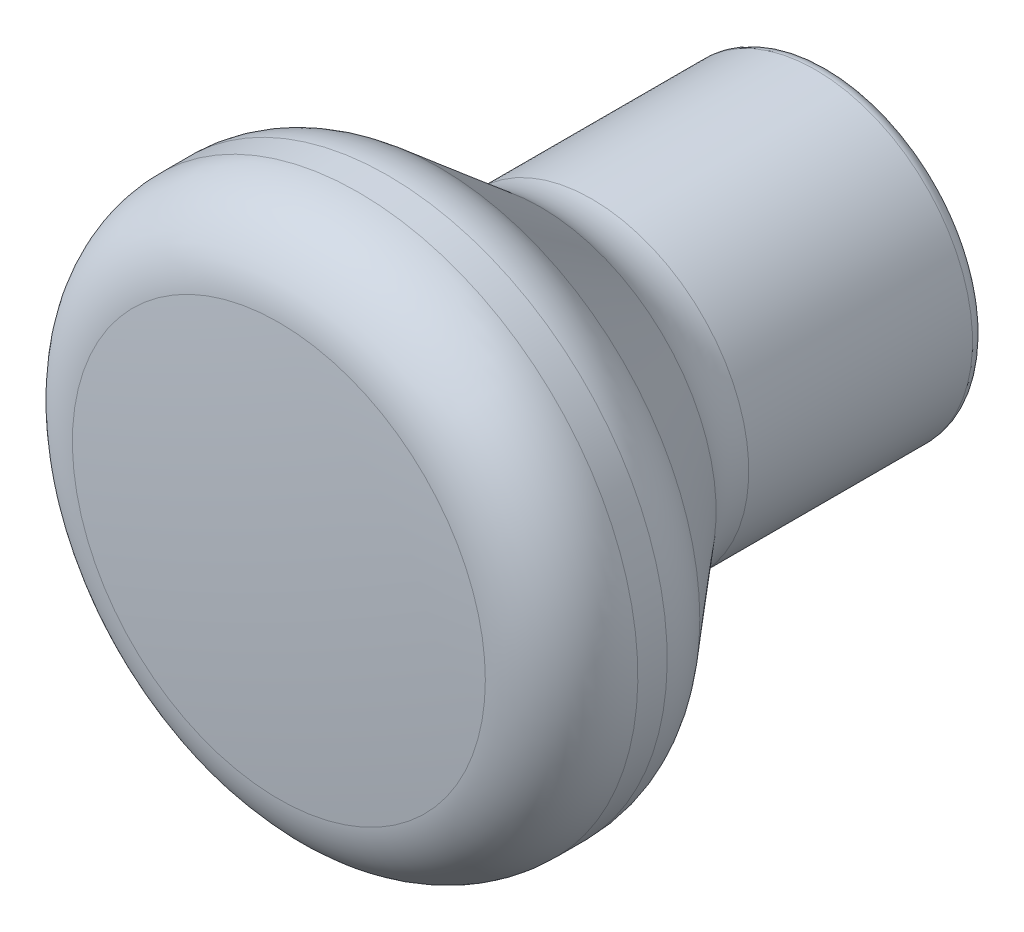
ISO-10303-21;
HEADER;
FILE_DESCRIPTION(('STEP AP214'),'2;1');
FILE_NAME('part.step','',(''),(''),'','','');
FILE_SCHEMA(('AUTOMOTIVE_DESIGN { 1 0 10303 214 1 1 1 1 }'));
ENDSEC;
DATA;
#1=APPLICATION_CONTEXT('core data for automotive mechanical design processes');
#2=APPLICATION_PROTOCOL_DEFINITION('international standard','automotive_design',2000,#1);
#3=PRODUCT_CONTEXT('',#1,'mechanical');
#4=PRODUCT('Part','Part','',(#3));
#5=PRODUCT_RELATED_PRODUCT_CATEGORY('part','',(#4));
#6=PRODUCT_DEFINITION_FORMATION('','',#4);
#7=PRODUCT_DEFINITION_CONTEXT('part definition',#1,'design');
#8=PRODUCT_DEFINITION('design','',#6,#7);
#9=PRODUCT_DEFINITION_SHAPE('','',#8);
#10=(LENGTH_UNIT() NAMED_UNIT(*) SI_UNIT(.MILLI.,.METRE.));
#11=(NAMED_UNIT(*) PLANE_ANGLE_UNIT() SI_UNIT($,.RADIAN.));
#12=(NAMED_UNIT(*) SI_UNIT($,.STERADIAN.) SOLID_ANGLE_UNIT());
#13=UNCERTAINTY_MEASURE_WITH_UNIT(LENGTH_MEASURE(1.E-05),#10,'distance_accuracy_value','');
#14=(GEOMETRIC_REPRESENTATION_CONTEXT(3) GLOBAL_UNCERTAINTY_ASSIGNED_CONTEXT((#13)) GLOBAL_UNIT_ASSIGNED_CONTEXT((#10,
#11,#12)) REPRESENTATION_CONTEXT('',''));
#15=CARTESIAN_POINT('',(0.,0.,0.));
#16=DIRECTION('',(0.,0.,1.));
#17=DIRECTION('',(1.,0.,0.));
#18=AXIS2_PLACEMENT_3D('',#15,#16,#17);
#19=CARTESIAN_POINT('',(-6.90853624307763E-13,0.,-69.0000000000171));
#20=DIRECTION('',(0.,0.,-1.));
#21=DIRECTION('',(1.,0.,0.));
#22=AXIS2_PLACEMENT_3D('',#19,#20,#21);
#23=SPHERICAL_SURFACE('',#22,90.0000000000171);
#24=CARTESIAN_POINT('',(0.,0.,20.664953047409));
#25=DIRECTION('',(0.,0.,-1.));
#26=DIRECTION('',(0.,1.,0.));
#27=AXIS2_PLACEMENT_3D('',#24,#25,#26);
#28=CIRCLE('',#27,7.75862068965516);
#29=CARTESIAN_POINT('',(0.,7.75862068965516,20.664953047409));
#30=VERTEX_POINT('',#29);
#31=EDGE_CURVE('E8',#30,#30,#28,.T.);
#32=ORIENTED_EDGE('',*,*,#31,.F.);
#33=EDGE_LOOP('',(#32));
#34=FACE_BOUND('',#33,.T.);
#35=ADVANCED_FACE('F12',(#34),#23,.T.);
#36=CARTESIAN_POINT('',(0.,0.,17.676121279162));
#37=DIRECTION('',(0.,0.,-1.));
#38=DIRECTION('',(0.,1.,0.));
#39=AXIS2_PLACEMENT_3D('',#36,#37,#38);
#40=TOROIDAL_SURFACE('',#39,7.5,3.);
#41=ORIENTED_EDGE('',*,*,#31,.T.);
#42=EDGE_LOOP('',(#41));
#43=FACE_BOUND('',#42,.T.);
#44=CARTESIAN_POINT('',(0.,0.,17.676121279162));
#45=DIRECTION('',(0.,0.,-1.));
#46=DIRECTION('',(0.,1.,0.));
#47=AXIS2_PLACEMENT_3D('',#44,#45,#46);
#48=CIRCLE('',#47,10.5);
#49=CARTESIAN_POINT('',(0.,10.5,17.676121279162));
#50=VERTEX_POINT('',#49);
#51=EDGE_CURVE('E18',#50,#50,#48,.T.);
#52=ORIENTED_EDGE('',*,*,#51,.F.);
#53=EDGE_LOOP('',(#52));
#54=FACE_BOUND('',#53,.T.);
#55=ADVANCED_FACE('F77',(#43,#54),#40,.T.);
#56=CARTESIAN_POINT('',(0.,0.,0.));
#57=DIRECTION('',(0.,0.,-1.));
#58=DIRECTION('',(0.,1.,0.));
#59=AXIS2_PLACEMENT_3D('',#56,#57,#58);
#60=CYLINDRICAL_SURFACE('',#59,10.5);
#61=CARTESIAN_POINT('',(0.,0.,16.573977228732));
#62=DIRECTION('',(0.,0.,-1.));
#63=DIRECTION('',(0.,1.,0.));
#64=AXIS2_PLACEMENT_3D('',#61,#62,#63);
#65=CIRCLE('',#64,10.5);
#66=CARTESIAN_POINT('',(0.,10.5,16.573977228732));
#67=VERTEX_POINT('',#66);
#68=EDGE_CURVE('E22',#67,#67,#65,.T.);
#69=ORIENTED_EDGE('',*,*,#68,.F.);
#70=EDGE_LOOP('',(#69));
#71=FACE_BOUND('',#70,.T.);
#72=ORIENTED_EDGE('',*,*,#51,.T.);
#73=EDGE_LOOP('',(#72));
#74=FACE_BOUND('',#73,.T.);
#75=ADVANCED_FACE('F82',(#71,#74),#60,.T.);
#76=CARTESIAN_POINT('',(0.,0.,16.573977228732));
#77=DIRECTION('',(0.,0.,-1.));
#78=DIRECTION('',(0.,1.,0.));
#79=AXIS2_PLACEMENT_3D('',#76,#77,#78);
#80=TOROIDAL_SURFACE('',#79,7.5,3.);
#81=ORIENTED_EDGE('',*,*,#68,.T.);
#82=EDGE_LOOP('',(#81));
#83=FACE_BOUND('',#82,.T.);
#84=CARTESIAN_POINT('',(0.,0.,14.6456143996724));
#85=DIRECTION('',(0.,0.,-1.));
#86=DIRECTION('',(0.,1.,0.));
#87=AXIS2_PLACEMENT_3D('',#84,#85,#86);
#88=CIRCLE('',#87,9.79813332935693);
#89=CARTESIAN_POINT('',(0.,9.79813332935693,14.6456143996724));
#90=VERTEX_POINT('',#89);
#91=EDGE_CURVE('E26',#90,#90,#88,.T.);
#92=ORIENTED_EDGE('',*,*,#91,.F.);
#93=EDGE_LOOP('',(#92));
#94=FACE_BOUND('',#93,.T.);
#95=ADVANCED_FACE('F86',(#83,#94),#80,.T.);
#96=CARTESIAN_POINT('',(0.,0.,14.6456143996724));
#97=DIRECTION('',(0.,0.,1.));
#98=DIRECTION('',(0.,-1.,0.));
#99=AXIS2_PLACEMENT_3D('',#96,#97,#98);
#100=CONICAL_SURFACE('',#99,9.79813332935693,0.698131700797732);
#101=CARTESIAN_POINT('',(0.,0.,10.836452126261));
#102=DIRECTION('',(0.,0.,-1.));
#103=DIRECTION('',(0.,1.,0.));
#104=AXIS2_PLACEMENT_3D('',#101,#102,#103);
#105=CIRCLE('',#104,6.60186667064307);
#106=CARTESIAN_POINT('',(0.,6.60186667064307,10.836452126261));
#107=VERTEX_POINT('',#106);
#108=EDGE_CURVE('E31',#107,#107,#105,.T.);
#109=ORIENTED_EDGE('',*,*,#108,.F.);
#110=EDGE_LOOP('',(#109));
#111=FACE_BOUND('',#110,.T.);
#112=ORIENTED_EDGE('',*,*,#91,.T.);
#113=EDGE_LOOP('',(#112));
#114=FACE_BOUND('',#113,.T.);
#115=ADVANCED_FACE('F93',(#111,#114),#100,.T.);
#116=CARTESIAN_POINT('',(0.,0.,8.90808929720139));
#117=DIRECTION('',(0.,0.,-1.));
#118=DIRECTION('',(0.,1.,0.));
#119=AXIS2_PLACEMENT_3D('',#116,#117,#118);
#120=TOROIDAL_SURFACE('',#119,8.9,3.);
#121=CARTESIAN_POINT('',(0.,0.,8.90808929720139));
#122=DIRECTION('',(0.,0.,-1.));
#123=DIRECTION('',(0.,1.,0.));
#124=AXIS2_PLACEMENT_3D('',#121,#122,#123);
#125=CIRCLE('',#124,5.9);
#126=CARTESIAN_POINT('',(0.,5.9,8.90808929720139));
#127=VERTEX_POINT('',#126);
#128=EDGE_CURVE('E34',#127,#127,#125,.T.);
#129=ORIENTED_EDGE('',*,*,#128,.F.);
#130=EDGE_LOOP('',(#129));
#131=FACE_BOUND('',#130,.T.);
#132=ORIENTED_EDGE('',*,*,#108,.T.);
#133=EDGE_LOOP('',(#132));
#134=FACE_BOUND('',#133,.T.);
#135=ADVANCED_FACE('F73',(#131,#134),#120,.F.);
#136=CARTESIAN_POINT('',(0.,0.,0.));
#137=DIRECTION('',(0.,0.,-1.));
#138=DIRECTION('',(0.,1.,0.));
#139=AXIS2_PLACEMENT_3D('',#136,#137,#138);
#140=CYLINDRICAL_SURFACE('',#139,5.9);
#141=CARTESIAN_POINT('',(0.,0.,0.5));
#142=DIRECTION('',(0.,0.,-1.));
#143=DIRECTION('',(0.,1.,0.));
#144=AXIS2_PLACEMENT_3D('',#141,#142,#143);
#145=CIRCLE('',#144,5.9);
#146=CARTESIAN_POINT('',(0.,5.9,0.5));
#147=VERTEX_POINT('',#146);
#148=EDGE_CURVE('E37',#147,#147,#145,.T.);
#149=ORIENTED_EDGE('',*,*,#148,.F.);
#150=EDGE_LOOP('',(#149));
#151=FACE_BOUND('',#150,.T.);
#152=ORIENTED_EDGE('',*,*,#128,.T.);
#153=EDGE_LOOP('',(#152));
#154=FACE_BOUND('',#153,.T.);
#155=ADVANCED_FACE('F66',(#151,#154),#140,.T.);
#156=CARTESIAN_POINT('',(0.,0.,0.5));
#157=DIRECTION('',(0.,0.,-1.));
#158=DIRECTION('',(0.,1.,0.));
#159=AXIS2_PLACEMENT_3D('',#156,#157,#158);
#160=TOROIDAL_SURFACE('',#159,5.4,0.5);
#161=ORIENTED_EDGE('',*,*,#148,.T.);
#162=EDGE_LOOP('',(#161));
#163=FACE_BOUND('',#162,.T.);
#164=CARTESIAN_POINT('',(0.,0.,0.));
#165=DIRECTION('',(0.,0.,-1.));
#166=DIRECTION('',(0.,1.,0.));
#167=AXIS2_PLACEMENT_3D('',#164,#165,#166);
#168=CIRCLE('',#167,5.4);
#169=CARTESIAN_POINT('',(0.,5.4,0.));
#170=VERTEX_POINT('',#169);
#171=EDGE_CURVE('E40',#170,#170,#168,.T.);
#172=ORIENTED_EDGE('',*,*,#171,.F.);
#173=EDGE_LOOP('',(#172));
#174=FACE_BOUND('',#173,.T.);
#175=ADVANCED_FACE('F61',(#163,#174),#160,.T.);
#176=CARTESIAN_POINT('',(5.4,0.,0.));
#177=DIRECTION('',(0.,0.,1.));
#178=DIRECTION('',(0.,-1.,0.));
#179=AXIS2_PLACEMENT_3D('',#176,#177,#178);
#180=PLANE('',#179);
#181=CARTESIAN_POINT('',(0.,0.,0.));
#182=DIRECTION('',(0.,0.,-1.));
#183=DIRECTION('',(0.,1.,0.));
#184=AXIS2_PLACEMENT_3D('',#181,#182,#183);
#185=CIRCLE('',#184,2.5);
#186=CARTESIAN_POINT('',(0.,2.5,0.));
#187=VERTEX_POINT('',#186);
#188=EDGE_CURVE('E44',#187,#187,#185,.T.);
#189=ORIENTED_EDGE('',*,*,#188,.F.);
#190=EDGE_LOOP('',(#189));
#191=FACE_BOUND('',#190,.T.);
#192=ORIENTED_EDGE('',*,*,#171,.T.);
#193=EDGE_LOOP('',(#192));
#194=FACE_BOUND('',#193,.T.);
#195=ADVANCED_FACE('F55',(#191,#194),#180,.F.);
#196=CARTESIAN_POINT('',(0.,0.,12.));
#197=DIRECTION('',(0.,0.,-1.));
#198=DIRECTION('',(0.,1.,0.));
#199=AXIS2_PLACEMENT_3D('',#196,#197,#198);
#200=CYLINDRICAL_SURFACE('',#199,2.5);
#201=CARTESIAN_POINT('',(0.,0.,12.));
#202=DIRECTION('',(0.,0.,-1.));
#203=DIRECTION('',(0.,1.,0.));
#204=AXIS2_PLACEMENT_3D('',#201,#202,#203);
#205=CIRCLE('',#204,2.5);
#206=CARTESIAN_POINT('',(0.,2.5,12.));
#207=VERTEX_POINT('',#206);
#208=EDGE_CURVE('E43',#207,#207,#205,.T.);
#209=ORIENTED_EDGE('',*,*,#208,.F.);
#210=EDGE_LOOP('',(#209));
#211=FACE_BOUND('',#210,.T.);
#212=ORIENTED_EDGE('',*,*,#188,.T.);
#213=EDGE_LOOP('',(#212));
#214=FACE_BOUND('',#213,.T.);
#215=ADVANCED_FACE('F52',(#211,#214),#200,.F.);
#216=CARTESIAN_POINT('',(0.,0.,12.));
#217=DIRECTION('',(0.,0.,-1.));
#218=DIRECTION('',(0.,1.,0.));
#219=AXIS2_PLACEMENT_3D('',#216,#217,#218);
#220=PLANE('',#219);
#221=ORIENTED_EDGE('',*,*,#208,.T.);
#222=EDGE_LOOP('',(#221));
#223=FACE_BOUND('',#222,.T.);
#224=ADVANCED_FACE('F50',(#223),#220,.T.);
#225=CLOSED_SHELL('',(#35,#55,#75,#95,#115,#135,#155,#175,#195,#215,#224));
#226=MANIFOLD_SOLID_BREP('B1',#225);
#227=ADVANCED_BREP_SHAPE_REPRESENTATION('',(#18,#226),#14);
#228=SHAPE_DEFINITION_REPRESENTATION(#9,#227);
ENDSEC;
END-ISO-10303-21;
